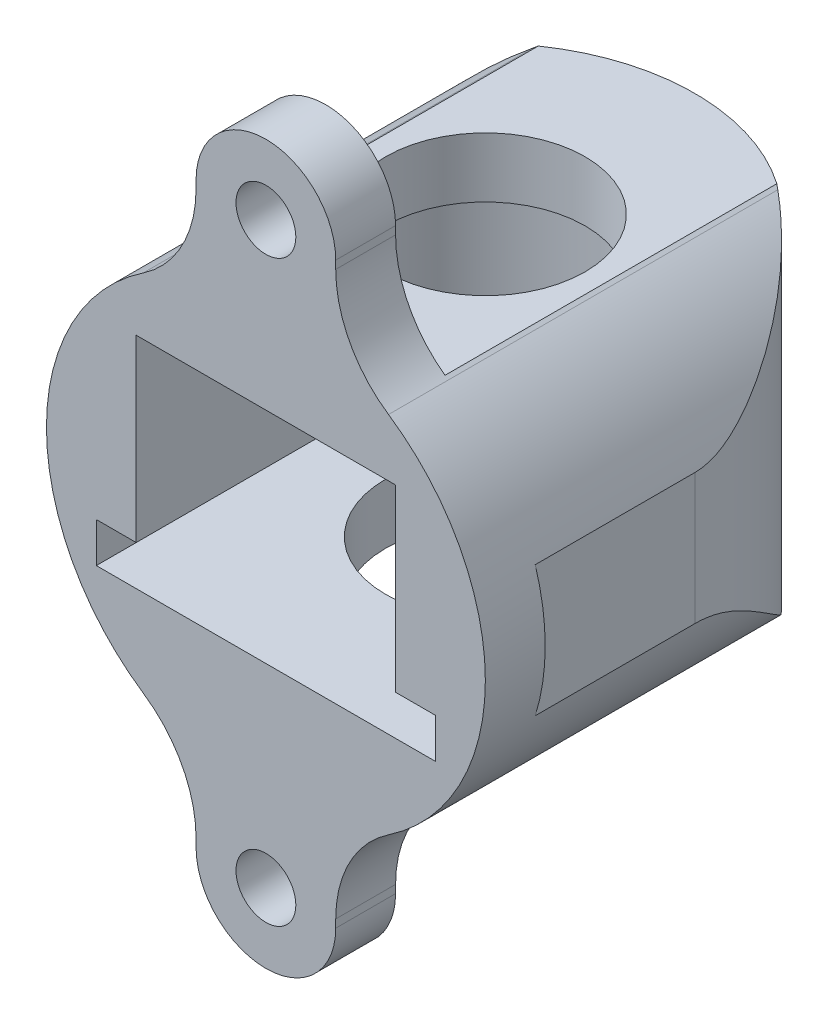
from build123d import *

# Parameters (mm, degrees)
REVOLVE2_ANGLE          = 180.0000000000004
BOSS_EXTRUDE1_DEPTH     = 11
CUT_EXTRUDE1_DEPTH      = 23.80898945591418
CUT_EXTRUDE1_DEPTH_BACK = 23.80898945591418
SKETCH4_R               = 5
SKETCH5_R               = 1.4999999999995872
SKETCH5_R_2             = 1.499999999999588
BOSS_EXTRUDE2_DEPTH     = 3
CUT_EXTRUDE2_DEPTH      = 34.18535219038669
CUT_EXTRUDE2_DEPTH_BACK = 34.18535219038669


with BuildPart() as part:
    # Sketch2 → Revolve2 (revolve)
    with BuildSketch(Plane.XY):
        Polygon((8.5, 3.12e-15), (0, 1.56e-15), (1.047e-14, -3), (10.5, -3), (10.499999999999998, 14.000000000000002), (1.2e-16, 14.000000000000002), (-3.841e-14, 10.99999999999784), (6.500000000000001, 11.000000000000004), (6.500000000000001, 2.0000000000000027), (8.5, 2.000000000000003), align=None)
    revolve(axis=Axis((3.49148e-12, -1000, 0), (-3.49e-15, 1, 0)), revolution_arc=REVOLVE2_ANGLE)

    # Sketch3 → Boss-Extrude1 (add)
    with BuildSketch(Plane.XY):
        Polygon((-10.49999999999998, -3.0000000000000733), (10.5, -3), (10.499999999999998, 14.000000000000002), (-10.500000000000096, 13.999999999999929), align=None)
        Polygon((-6.500000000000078, 10.999999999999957), (6.500000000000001, 11.000000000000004), (6.500000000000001, 2.0000000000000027), (8.5, 2.000000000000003), (8.5, 3.12e-15), (-8.5, -5.623e-14), (-8.500000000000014, 1.9999999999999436), (-6.500000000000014, 1.9999999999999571), align=None, mode=Mode.SUBTRACT)
    extrude(amount=BOSS_EXTRUDE1_DEPTH)

    # Sketch4 → Cut-Extrude1 (cut, two sides: drawn at the far end of the back side and taken through both)
    with BuildSketch(Plane.XZ.offset(3.000000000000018).offset(-CUT_EXTRUDE1_DEPTH_BACK)):
        Circle(SKETCH4_R)
    extrude(amount=CUT_EXTRUDE1_DEPTH + CUT_EXTRUDE1_DEPTH_BACK, mode=Mode.SUBTRACT)

    # Sketch5 → Boss-Extrude2 (add)
    # profile 1 of 4: a face of its own
    with BuildSketch(Plane(origin=(0, 0, 11), x_dir=(-1, 0, 0), z_dir=(0, 0, 1))):
        with BuildLine():
            Line((-7.796306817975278, 3.0000000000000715), (0, 3.0000000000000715))
            Line((0, 3.0000000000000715), (7.796306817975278, 3.0000000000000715))
            ThreePointArc((7.796306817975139, 2.999999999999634), (7.004871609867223, 3.721260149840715), (6.147058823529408, 4.3621525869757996))
            ThreePointArc((6.147058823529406, 4.3621525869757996), (4.202941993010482, 6.519862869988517), (3.5, 9.337872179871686))
            Line((3.4999999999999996, 9.337872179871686), (3.4999999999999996, 9.74))
            ThreePointArc((3.4999999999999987, 9.74), (-5.6e-16, 13.240000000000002), (-3.500000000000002, 9.740000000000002))
            Line((-3.5000000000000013, 9.740000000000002), (-3.5000000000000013, 9.337872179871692))
            ThreePointArc((-3.500000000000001, 9.337872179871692), (-4.202941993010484, 6.519862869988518), (-6.147058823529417, 4.362152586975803))
            ThreePointArc((-6.147058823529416, 4.362152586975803), (-7.004871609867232, 3.7212601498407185), (-7.796306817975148, 2.9999999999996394))
        make_face()
        with Locations(Location((-1.7e-16, 9.740000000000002, 0), (0, 0, 180))):
            Circle(SKETCH5_R, mode=Mode.SUBTRACT)
    # profile 2 of 4: a face of its own
    with BuildSketch(Plane(origin=(0, 0, 11), x_dir=(-1, 0, 0), z_dir=(0, 0, 1))):
        with BuildLine():
            Line((-10.499999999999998, -8.038719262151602), (-10.5, -1.4812807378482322))
            ThreePointArc((-10.499999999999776, -1.4812807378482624), (-11.000000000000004, -4.759999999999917), (-10.499999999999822, -8.038719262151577))
        make_face()
    # profile 3 of 4: a face of its own
    with BuildSketch(Plane(origin=(0, 0, 11), x_dir=(-1, 0, 0), z_dir=(0, 0, 1))):
        with BuildLine():
            ThreePointArc((10.499999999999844, -8.038719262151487), (10.999999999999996, -4.760000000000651), (10.500000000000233, -1.4812807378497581))
            Line((10.50000000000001, -1.4812807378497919), (10.500000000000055, -8.038719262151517))
        make_face()
    # profile 4 of 4: a face of its own
    with BuildSketch(Plane(origin=(0, 0, 11), x_dir=(-1, 0, 0), z_dir=(0, 0, 1))):
        with BuildLine():
            Line((5.978483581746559, -13.999999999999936), (-5.978483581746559, -13.999999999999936))
            ThreePointArc((-5.978483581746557, -13.999999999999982), (-4.1554187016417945, -16.131069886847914), (-3.5000000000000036, -18.857872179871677))
            Line((-3.500000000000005, -18.857872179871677), (-3.5000000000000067, -19.25999999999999))
            ThreePointArc((-3.500000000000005, -19.25999999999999), (-6.21e-15, -22.76), (3.4999999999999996, -19.259999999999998))
            Line((3.499999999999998, -19.259999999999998), (3.499999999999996, -18.857872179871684))
            ThreePointArc((3.4999999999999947, -18.857872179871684), (4.1554187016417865, -16.131069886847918), (5.978483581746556, -13.99999999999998))
        make_face()
        with Locations(Location((-3.5e-15, -19.259999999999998, 0), (0, 0, 180))):
            Circle(SKETCH5_R_2, mode=Mode.SUBTRACT)
    extrude(amount=-BOSS_EXTRUDE2_DEPTH)

    # Sketch5_3 → Cut-Extrude2 (cut, two sides: drawn at the far end of the back side and taken through both)
    with BuildSketch(Plane(origin=(0, 0, 11), x_dir=(-1, 0, 0), z_dir=(0, 0, 1)).offset(-CUT_EXTRUDE2_DEPTH_BACK)):
        with BuildLine():
            ThreePointArc((-10.499999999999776, -1.4812807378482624), (-9.418555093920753, 0.9225012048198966), (-7.796306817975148, 2.9999999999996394))
            Line((-7.796306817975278, 3.0000000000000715), (-10.5, 3.0000000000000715))
            Line((-10.5, 3), (-10.5, -1.4812807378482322))
        make_face()
        with BuildLine():
            Line((10.5, 3.0000000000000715), (7.796306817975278, 3.0000000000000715))
            ThreePointArc((7.796306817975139, 2.999999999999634), (9.418555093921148, 0.9225012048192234), (10.500000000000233, -1.4812807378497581))
            Line((10.50000000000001, -1.4812807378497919), (10.49999999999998, 3.0000000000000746))
        make_face()
        with BuildLine():
            ThreePointArc((-6.147058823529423, -13.882152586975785), (-8.821426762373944, -11.331333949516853), (-10.499999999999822, -8.038719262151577))
            Line((-10.499999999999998, -8.038719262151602), (-10.499999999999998, -14))
            Line((-10.5, -13.999999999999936), (-5.978483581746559, -13.999999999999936))
            ThreePointArc((-5.978483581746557, -13.999999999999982), (-6.062266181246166, -13.940353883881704), (-6.147058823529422, -13.882152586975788))
        make_face()
        with BuildLine():
            Line((10.500000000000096, -13.999999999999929), (10.500000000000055, -8.038719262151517))
            ThreePointArc((10.499999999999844, -8.038719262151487), (8.821426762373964, -11.33133394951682), (6.147058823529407, -13.882152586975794))
            ThreePointArc((6.147058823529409, -13.882152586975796), (6.062266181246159, -13.940353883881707), (5.978483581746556, -13.99999999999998))
            Line((5.978483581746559, -13.999999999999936), (10.500000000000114, -13.999999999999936))
        make_face()
    extrude(amount=CUT_EXTRUDE2_DEPTH + CUT_EXTRUDE2_DEPTH_BACK, mode=Mode.SUBTRACT)


solid = part.part
